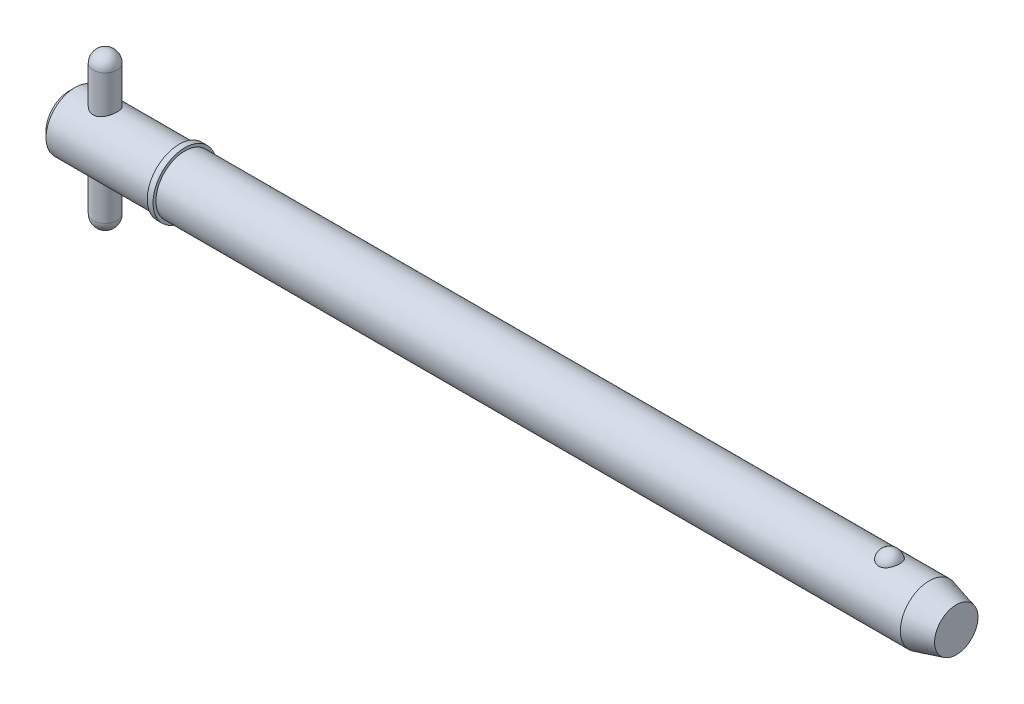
ISO-10303-21;
HEADER;
FILE_DESCRIPTION(('STEP AP214'),'2;1');
FILE_NAME('part.step','',(''),(''),'','','');
FILE_SCHEMA(('AUTOMOTIVE_DESIGN { 1 0 10303 214 1 1 1 1 }'));
ENDSEC;
DATA;
#1=APPLICATION_CONTEXT('core data for automotive mechanical design processes');
#2=APPLICATION_PROTOCOL_DEFINITION('international standard','automotive_design',2000,#1);
#3=PRODUCT_CONTEXT('',#1,'mechanical');
#4=PRODUCT('Part','Part','',(#3));
#5=PRODUCT_RELATED_PRODUCT_CATEGORY('part','',(#4));
#6=PRODUCT_DEFINITION_FORMATION('','',#4);
#7=PRODUCT_DEFINITION_CONTEXT('part definition',#1,'design');
#8=PRODUCT_DEFINITION('design','',#6,#7);
#9=PRODUCT_DEFINITION_SHAPE('','',#8);
#10=(LENGTH_UNIT() NAMED_UNIT(*) SI_UNIT(.MILLI.,.METRE.));
#11=(NAMED_UNIT(*) PLANE_ANGLE_UNIT() SI_UNIT($,.RADIAN.));
#12=(NAMED_UNIT(*) SI_UNIT($,.STERADIAN.) SOLID_ANGLE_UNIT());
#13=UNCERTAINTY_MEASURE_WITH_UNIT(LENGTH_MEASURE(1.E-05),#10,'distance_accuracy_value','');
#14=(GEOMETRIC_REPRESENTATION_CONTEXT(3) GLOBAL_UNCERTAINTY_ASSIGNED_CONTEXT((#13)) GLOBAL_UNIT_ASSIGNED_CONTEXT((#10,
#11,#12)) REPRESENTATION_CONTEXT('',''));
#15=CARTESIAN_POINT('',(0.,0.,0.));
#16=DIRECTION('',(0.,0.,1.));
#17=DIRECTION('',(1.,0.,0.));
#18=AXIS2_PLACEMENT_3D('',#15,#16,#17);
#19=CARTESIAN_POINT('',(5.94,12.7,0.));
#20=DIRECTION('',(0.,-1.,0.));
#21=DIRECTION('',(0.,0.,-1.));
#22=AXIS2_PLACEMENT_3D('',#19,#20,#21);
#23=CYLINDRICAL_SURFACE('',#22,1.98);
#24=CARTESIAN_POINT('',(5.94,-10.72,0.));
#25=DIRECTION('',(0.,-1.,0.));
#26=DIRECTION('',(0.,0.,-1.));
#27=AXIS2_PLACEMENT_3D('',#24,#25,#26);
#28=CIRCLE('',#27,1.98);
#29=CARTESIAN_POINT('',(5.94,-10.72,-1.98));
#30=VERTEX_POINT('',#29);
#31=EDGE_CURVE('P0_E10',#30,#30,#28,.F.);
#32=ORIENTED_EDGE('',*,*,#31,.T.);
#33=EDGE_LOOP('',(#32));
#34=FACE_BOUND('',#33,.T.);
#35=CARTESIAN_POINT('',(5.94,10.72,0.));
#36=DIRECTION('',(0.,-1.,0.));
#37=DIRECTION('',(0.,0.,-1.));
#38=AXIS2_PLACEMENT_3D('',#35,#36,#37);
#39=CIRCLE('',#38,1.98);
#40=CARTESIAN_POINT('',(5.94,10.72,-1.98));
#41=VERTEX_POINT('',#40);
#42=EDGE_CURVE('P0_E21',#41,#41,#39,.T.);
#43=ORIENTED_EDGE('',*,*,#42,.T.);
#44=EDGE_LOOP('',(#43));
#45=FACE_BOUND('',#44,.T.);
#46=ADVANCED_FACE('P0_F14',(#34,#45),#23,.T.);
#47=CARTESIAN_POINT('',(5.94,-10.72,0.));
#48=DIRECTION('',(0.,0.,1.));
#49=DIRECTION('',(1.,0.,0.));
#50=AXIS2_PLACEMENT_3D('',#47,#48,#49);
#51=SPHERICAL_SURFACE('',#50,1.98);
#52=CARTESIAN_POINT('',(5.94,-10.72,0.));
#53=DIRECTION('',(0.,-1.,0.));
#54=DIRECTION('',(0.,0.,-1.));
#55=AXIS2_PLACEMENT_3D('',#52,#53,#54);
#56=SPHERICAL_SURFACE('',#55,1.98);
#57=ORIENTED_EDGE('',*,*,#31,.F.);
#58=EDGE_LOOP('',(#57));
#59=FACE_BOUND('',#58,.T.);
#60=ADVANCED_FACE('P0_F29',(#59),#56,.T.);
#61=CARTESIAN_POINT('',(5.94,10.72,0.));
#62=DIRECTION('',(0.,0.,1.));
#63=DIRECTION('',(1.,0.,0.));
#64=AXIS2_PLACEMENT_3D('',#61,#62,#63);
#65=SPHERICAL_SURFACE('',#64,1.98);
#66=CARTESIAN_POINT('',(5.94,10.72,0.));
#67=DIRECTION('',(0.,-1.,0.));
#68=DIRECTION('',(0.,0.,-1.));
#69=AXIS2_PLACEMENT_3D('',#66,#67,#68);
#70=SPHERICAL_SURFACE('',#69,1.98);
#71=ORIENTED_EDGE('',*,*,#42,.F.);
#72=EDGE_LOOP('',(#71));
#73=FACE_BOUND('',#72,.T.);
#74=ADVANCED_FACE('P0_F16',(#73),#70,.T.);
#75=CLOSED_SHELL('',(#46,#60,#74));
#76=MANIFOLD_SOLID_BREP('P0_B1',#75);
#77=CARTESIAN_POINT('',(0.,0.,0.));
#78=DIRECTION('',(1.,0.,0.));
#79=DIRECTION('',(0.,0.,-1.));
#80=AXIS2_PLACEMENT_3D('',#77,#78,#79);
#81=CYLINDRICAL_SURFACE('',#80,4.765);
#82=CARTESIAN_POINT('',(141.604194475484,0.,0.));
#83=DIRECTION('',(1.,0.,0.));
#84=DIRECTION('',(0.,0.,-1.));
#85=AXIS2_PLACEMENT_3D('',#82,#83,#84);
#86=CIRCLE('',#85,4.765);
#87=CARTESIAN_POINT('',(141.604194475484,0.,-4.765));
#88=VERTEX_POINT('',#87);
#89=EDGE_CURVE('P1_E81',#88,#88,#86,.T.);
#90=ORIENTED_EDGE('',*,*,#89,.F.);
#91=EDGE_LOOP('',(#90));
#92=FACE_BOUND('',#91,.T.);
#93=CARTESIAN_POINT('',(19.05,0.,0.));
#94=DIRECTION('',(1.,0.,0.));
#95=DIRECTION('',(0.,0.,-1.));
#96=AXIS2_PLACEMENT_3D('',#93,#94,#95);
#97=CIRCLE('',#96,4.765);
#98=CARTESIAN_POINT('',(19.05,0.,-4.765));
#99=VERTEX_POINT('',#98);
#100=EDGE_CURVE('P1_E85',#99,#99,#97,.T.);
#101=ORIENTED_EDGE('',*,*,#100,.T.);
#102=EDGE_LOOP('',(#101));
#103=FACE_BOUND('',#102,.T.);
#104=CARTESIAN_POINT('',(135.051020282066,4.42764777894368,1.76101111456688));
#105=CARTESIAN_POINT('',(134.959721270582,4.42764470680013,1.76101422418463));
#106=CARTESIAN_POINT('',(134.868446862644,4.43059091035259,1.75366340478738));
#107=CARTESIAN_POINT('',(134.688615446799,4.44201846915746,1.72451180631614));
#108=CARTESIAN_POINT('',(134.600057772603,4.45049845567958,1.70271460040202));
#109=CARTESIAN_POINT('',(134.428257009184,4.47200516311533,1.64539370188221));
#110=CARTESIAN_POINT('',(134.345006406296,4.48502527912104,1.60988994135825));
#111=CARTESIAN_POINT('',(134.185763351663,4.51419542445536,1.52617873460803));
#112=CARTESIAN_POINT('',(134.109772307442,4.53034605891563,1.47796883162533));
#113=CARTESIAN_POINT('',(133.964744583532,4.56459317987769,1.36860494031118));
#114=CARTESIAN_POINT('',(133.895964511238,4.58273170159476,1.30712420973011));
#115=CARTESIAN_POINT('',(133.769342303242,4.61870302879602,1.17370204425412));
#116=CARTESIAN_POINT('',(133.711502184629,4.63653577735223,1.10175868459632));
#117=CARTESIAN_POINT('',(133.605570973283,4.67090140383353,0.945806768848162));
#118=CARTESIAN_POINT('',(133.558030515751,4.68734068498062,0.861402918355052));
#119=CARTESIAN_POINT('',(133.477081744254,4.71628466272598,0.685442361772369));
#120=CARTESIAN_POINT('',(133.443674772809,4.72878898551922,0.593884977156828));
#121=CARTESIAN_POINT('',(133.391287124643,4.74874061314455,0.404781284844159));
#122=CARTESIAN_POINT('',(133.372517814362,4.75611366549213,0.307168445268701));
#123=CARTESIAN_POINT('',(133.350584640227,4.76475393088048,0.109940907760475));
#124=CARTESIAN_POINT('',(133.347420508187,4.76602124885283,0.0103262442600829));
#125=CARTESIAN_POINT('',(133.356740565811,4.76232928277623,-0.187629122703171));
#126=CARTESIAN_POINT('',(133.369158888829,4.7573962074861,-0.285973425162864));
#127=CARTESIAN_POINT('',(133.409280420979,4.74184975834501,-0.479027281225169));
#128=CARTESIAN_POINT('',(133.436983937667,4.7312362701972,-0.573736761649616));
#129=CARTESIAN_POINT('',(133.507158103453,4.70540026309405,-0.756973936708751));
#130=CARTESIAN_POINT('',(133.549646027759,4.69017235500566,-0.845494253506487));
#131=CARTESIAN_POINT('',(133.648520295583,4.6566986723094,-1.01378033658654));
#132=CARTESIAN_POINT('',(133.704907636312,4.63845268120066,-1.09354547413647));
#133=CARTESIAN_POINT('',(133.830552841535,4.60085438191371,-1.24228523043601));
#134=CARTESIAN_POINT('',(133.899843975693,4.58149930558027,-1.31123108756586));
#135=CARTESIAN_POINT('',(134.049606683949,4.54391653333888,-1.43607409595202));
#136=CARTESIAN_POINT('',(134.130077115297,4.52568872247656,-1.49197257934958));
#137=CARTESIAN_POINT('',(134.298150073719,4.49293007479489,-1.58786764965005));
#138=CARTESIAN_POINT('',(134.385544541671,4.47832346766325,-1.62820219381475));
#139=CARTESIAN_POINT('',(134.566553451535,4.45406011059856,-1.69345757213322));
#140=CARTESIAN_POINT('',(134.66016555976,4.44440151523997,-1.71838415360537));
#141=CARTESIAN_POINT('',(134.845893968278,4.43159888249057,-1.75112843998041));
#142=CARTESIAN_POINT('',(134.937849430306,4.42815213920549,-1.75974223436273));
#143=CARTESIAN_POINT('',(135.121965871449,4.427247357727,-1.76201865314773));
#144=CARTESIAN_POINT('',(135.214126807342,4.42978816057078,-1.7556841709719));
#145=CARTESIAN_POINT('',(135.393129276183,4.44038648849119,-1.72869560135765));
#146=CARTESIAN_POINT('',(135.480047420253,4.44827555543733,-1.70847853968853));
#147=CARTESIAN_POINT('',(135.649131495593,4.46852246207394,-1.65479562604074));
#148=CARTESIAN_POINT('',(135.731297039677,4.48088066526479,-1.62132869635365));
#149=CARTESIAN_POINT('',(135.890591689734,4.50907357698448,-1.54120560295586));
#150=CARTESIAN_POINT('',(135.967570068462,4.52497884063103,-1.49427526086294));
#151=CARTESIAN_POINT('',(136.112708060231,4.55845148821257,-1.38881222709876));
#152=CARTESIAN_POINT('',(136.180865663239,4.57601924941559,-1.33027689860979));
#153=CARTESIAN_POINT('',(136.310099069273,4.61196537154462,-1.1999104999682));
#154=CARTESIAN_POINT('',(136.370656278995,4.63034074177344,-1.12756415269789));
#155=CARTESIAN_POINT('',(136.479279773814,4.66513959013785,-0.97361299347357));
#156=CARTESIAN_POINT('',(136.527343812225,4.68156271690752,-0.892006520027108));
#157=CARTESIAN_POINT('',(136.611383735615,4.71130224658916,-0.718892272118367));
#158=CARTESIAN_POINT('',(136.646918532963,4.724501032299,-0.627149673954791));
#159=CARTESIAN_POINT('',(136.702952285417,4.74571823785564,-0.438611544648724));
#160=CARTESIAN_POINT('',(136.723450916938,4.75373654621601,-0.34181590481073));
#161=CARTESIAN_POINT('',(136.749033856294,4.76378905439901,-0.14563306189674));
#162=CARTESIAN_POINT('',(136.754076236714,4.76580697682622,-0.0462395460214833));
#163=CARTESIAN_POINT('',(136.748523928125,4.7636057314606,0.152038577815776));
#164=CARTESIAN_POINT('',(136.737929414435,4.75938663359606,0.250923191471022));
#165=CARTESIAN_POINT('',(136.701387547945,4.74516937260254,0.445004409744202));
#166=CARTESIAN_POINT('',(136.675496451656,4.73519238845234,0.540213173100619));
#167=CARTESIAN_POINT('',(136.608927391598,4.71049394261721,0.724662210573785));
#168=CARTESIAN_POINT('',(136.568248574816,4.69577220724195,0.813902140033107));
#169=CARTESIAN_POINT('',(136.472717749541,4.66303767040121,0.984313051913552));
#170=CARTESIAN_POINT('',(136.417804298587,4.64501070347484,1.06544688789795));
#171=CARTESIAN_POINT('',(136.295049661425,4.60764678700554,1.21692673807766));
#172=CARTESIAN_POINT('',(136.227208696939,4.58830985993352,1.28727293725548));
#173=CARTESIAN_POINT('',(136.080548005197,4.55060370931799,1.41479271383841));
#174=CARTESIAN_POINT('',(136.001791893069,4.53222967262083,1.47203785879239));
#175=CARTESIAN_POINT('',(135.834989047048,4.49849576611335,1.57212016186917));
#176=CARTESIAN_POINT('',(135.746941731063,4.48313608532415,1.6149564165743));
#177=CARTESIAN_POINT('',(135.559791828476,4.45676184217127,1.68642657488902));
#178=CARTESIAN_POINT('',(135.460365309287,4.44598302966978,1.71430590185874));
#179=CARTESIAN_POINT('',(135.257621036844,4.43142918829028,1.7515925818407));
#180=CARTESIAN_POINT('',(135.154304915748,4.42765125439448,1.76100759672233));
#181=CARTESIAN_POINT('',(135.051020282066,4.42764777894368,1.76101111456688));
#182=B_SPLINE_CURVE_WITH_KNOTS('',3,(#104,#105,#106,#107,#108,#109,#110,#111,#112,#113,#114,
#115,#116,#117,#118,#119,#120,#121,#122,#123,#124,#125,#126,#127,#128,#129,#130,#131,#132,#133,
#134,#135,#136,#137,#138,#139,#140,#141,#142,#143,#144,#145,#146,#147,#148,#149,#150,#151,#152,
#153,#154,#155,#156,#157,#158,#159,#160,#161,#162,#163,#164,#165,#166,#167,#168,#169,#170,#171,
#172,#173,#174,#175,#176,#177,#178,#179,#180,#181),.UNSPECIFIED.,.T.,.F.,(4,2,2,2,2,2,2,2,2,2,2,
2,2,2,2,2,2,2,2,2,2,2,2,2,2,2,2,2,2,2,2,2,2,2,2,2,2,2,4),(0.,0.273517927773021,
0.546968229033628,0.820022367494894,1.09312934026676,1.37393946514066,1.6548013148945,
1.94820420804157,2.24163496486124,2.53922817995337,2.83681628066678,3.13315071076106,
3.42949110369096,3.72617893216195,4.02288805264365,4.32037303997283,4.61782764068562,
4.90840095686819,5.19886582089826,5.47474855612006,5.75057789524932,6.0180997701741,
6.28564340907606,6.55907787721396,6.83257454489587,7.11962987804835,7.40673679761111,
7.70312663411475,7.9995228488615,8.29672237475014,8.59391856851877,8.89002850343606,
9.18615552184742,9.48358266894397,9.7810047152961,10.0767610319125,10.3725358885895,
10.6820893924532,10.991514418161),.UNSPECIFIED.);
#183=CARTESIAN_POINT('',(135.051020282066,4.42764777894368,1.76101111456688));
#184=VERTEX_POINT('',#183);
#185=EDGE_CURVE('P1_E35',#184,#184,#182,.T.);
#186=ORIENTED_EDGE('',*,*,#185,.T.);
#187=EDGE_LOOP('',(#186));
#188=FACE_BOUND('',#187,.T.);
#189=ADVANCED_FACE('P1_F13',(#92,#103,#188),#81,.T.);
#190=CARTESIAN_POINT('',(0.,0.,0.));
#191=DIRECTION('',(-1.,0.,0.));
#192=DIRECTION('',(0.,0.,1.));
#193=AXIS2_PLACEMENT_3D('',#190,#191,#192);
#194=PLANE('',#193);
#195=CARTESIAN_POINT('',(0.,0.,0.));
#196=DIRECTION('',(1.,0.,0.));
#197=DIRECTION('',(0.,0.,-1.));
#198=AXIS2_PLACEMENT_3D('',#195,#196,#197);
#199=CIRCLE('',#198,3.812);
#200=CARTESIAN_POINT('',(0.,0.,-3.812));
#201=VERTEX_POINT('',#200);
#202=EDGE_CURVE('P1_E9',#201,#201,#199,.T.);
#203=ORIENTED_EDGE('',*,*,#202,.F.);
#204=EDGE_LOOP('',(#203));
#205=FACE_BOUND('',#204,.T.);
#206=ADVANCED_FACE('P1_F15',(#205),#194,.T.);
#207=CARTESIAN_POINT('',(0.952999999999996,0.,0.));
#208=DIRECTION('',(1.,0.,0.));
#209=DIRECTION('',(0.,0.,-1.));
#210=AXIS2_PLACEMENT_3D('',#207,#208,#209);
#211=CONICAL_SURFACE('',#210,4.765,0.78539816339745);
#212=ORIENTED_EDGE('',*,*,#202,.T.);
#213=EDGE_LOOP('',(#212));
#214=FACE_BOUND('',#213,.T.);
#215=CARTESIAN_POINT('',(0.952999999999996,0.,0.));
#216=DIRECTION('',(1.,0.,0.));
#217=DIRECTION('',(0.,0.,-1.));
#218=AXIS2_PLACEMENT_3D('',#215,#216,#217);
#219=CIRCLE('',#218,4.765);
#220=CARTESIAN_POINT('',(0.952999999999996,0.,-4.765));
#221=VERTEX_POINT('',#220);
#222=EDGE_CURVE('P1_E26',#221,#221,#219,.T.);
#223=ORIENTED_EDGE('',*,*,#222,.F.);
#224=EDGE_LOOP('',(#223));
#225=FACE_BOUND('',#224,.T.);
#226=ADVANCED_FACE('P1_F77',(#214,#225),#211,.T.);
#227=CARTESIAN_POINT('',(0.,0.,0.));
#228=DIRECTION('',(1.,0.,0.));
#229=DIRECTION('',(0.,0.,-1.));
#230=AXIS2_PLACEMENT_3D('',#227,#228,#229);
#231=CYLINDRICAL_SURFACE('',#230,4.765);
#232=CARTESIAN_POINT('',(5.94,-4.33414639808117,1.98));
#233=CARTESIAN_POINT('',(5.83435484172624,-4.33415447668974,1.97999169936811));
#234=CARTESIAN_POINT('',(5.72854887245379,-4.33806396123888,1.97149330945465));
#235=CARTESIAN_POINT('',(5.51998191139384,-4.35319906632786,1.93783487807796));
#236=CARTESIAN_POINT('',(5.41723000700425,-4.3644446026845,1.91262947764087));
#237=CARTESIAN_POINT('',(5.21817294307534,-4.39274225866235,1.84670269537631));
#238=CARTESIAN_POINT('',(5.12184344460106,-4.40977076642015,1.80604432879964));
#239=CARTESIAN_POINT('',(4.93740039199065,-4.44768106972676,1.71055160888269));
#240=CARTESIAN_POINT('',(4.84928487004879,-4.46856193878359,1.65572066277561));
#241=CARTESIAN_POINT('',(4.67826533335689,-4.51326966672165,1.52981120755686));
#242=CARTESIAN_POINT('',(4.59593118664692,-4.53719608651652,1.45799365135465));
#243=CARTESIAN_POINT('',(4.44405452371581,-4.58448035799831,1.30170177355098));
#244=CARTESIAN_POINT('',(4.37451692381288,-4.60783798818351,1.21722260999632));
#245=CARTESIAN_POINT('',(4.24730683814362,-4.65256187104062,1.03353484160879));
#246=CARTESIAN_POINT('',(4.19027484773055,-4.67379892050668,0.933848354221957));
#247=CARTESIAN_POINT('',(4.0940363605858,-4.7106711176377,0.7252544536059));
#248=CARTESIAN_POINT('',(4.05482199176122,-4.72630873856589,0.61635113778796));
#249=CARTESIAN_POINT('',(3.99739515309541,-4.74951416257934,0.398397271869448));
#250=CARTESIAN_POINT('',(3.97820018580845,-4.7574579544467,0.289646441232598));
#251=CARTESIAN_POINT('',(3.95818309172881,-4.76574596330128,0.0701967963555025));
#252=CARTESIAN_POINT('',(3.95735355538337,-4.76609324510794,-0.0405012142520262));
#253=CARTESIAN_POINT('',(3.9735743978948,-4.75937098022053,-0.253561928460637));
#254=CARTESIAN_POINT('',(3.98954548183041,-4.75274912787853,-0.356023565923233));
#255=CARTESIAN_POINT('',(4.03706504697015,-4.73344665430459,-0.556659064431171));
#256=CARTESIAN_POINT('',(4.06861467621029,-4.72076558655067,-0.654832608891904));
#257=CARTESIAN_POINT('',(4.14677192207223,-4.69032846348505,-0.845904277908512));
#258=CARTESIAN_POINT('',(4.19360181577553,-4.67249797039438,-0.938699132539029));
#259=CARTESIAN_POINT('',(4.30077315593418,-4.63350852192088,-1.11535616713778));
#260=CARTESIAN_POINT('',(4.3611193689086,-4.61234839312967,-1.19921518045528));
#261=CARTESIAN_POINT('',(4.49853487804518,-4.56707259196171,-1.3618711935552));
#262=CARTESIAN_POINT('',(4.57648039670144,-4.5428537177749,-1.43990029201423));
#263=CARTESIAN_POINT('',(4.74440779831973,-4.49530722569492,-1.58211009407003));
#264=CARTESIAN_POINT('',(4.83439425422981,-4.47197995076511,-1.64628551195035));
#265=CARTESIAN_POINT('',(5.02755026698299,-4.42812342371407,-1.76092221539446));
#266=CARTESIAN_POINT('',(5.13105348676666,-4.40770990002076,-1.81086937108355));
#267=CARTESIAN_POINT('',(5.34607555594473,-4.37336901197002,-1.89231211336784));
#268=CARTESIAN_POINT('',(5.45758864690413,-4.3594370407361,-1.92382080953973));
#269=CARTESIAN_POINT('',(5.67777275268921,-4.34077746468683,-1.96554536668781));
#270=CARTESIAN_POINT('',(5.78616167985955,-4.33551319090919,-1.9770057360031));
#271=CARTESIAN_POINT('',(6.00341835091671,-4.33325118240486,-1.98196183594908));
#272=CARTESIAN_POINT('',(6.11228591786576,-4.33625061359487,-1.97546372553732));
#273=CARTESIAN_POINT('',(6.32012423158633,-4.34962383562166,-1.94582288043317));
#274=CARTESIAN_POINT('',(6.41928436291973,-4.35951709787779,-1.92376364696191));
#275=CARTESIAN_POINT('',(6.61241543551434,-4.38495043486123,-1.86506038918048));
#276=CARTESIAN_POINT('',(6.70638516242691,-4.40049182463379,-1.82841296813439));
#277=CARTESIAN_POINT('',(6.89090272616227,-4.43627016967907,-1.73985559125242));
#278=CARTESIAN_POINT('',(6.98113841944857,-4.45667771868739,-1.68736639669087));
#279=CARTESIAN_POINT('',(7.1519532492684,-4.49964530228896,-1.56919282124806));
#280=CARTESIAN_POINT('',(7.232528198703,-4.52220626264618,-1.50350275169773));
#281=CARTESIAN_POINT('',(7.38851617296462,-4.56914071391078,-1.35452895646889));
#282=CARTESIAN_POINT('',(7.46298462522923,-4.5935132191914,-1.27025197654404));
#283=CARTESIAN_POINT('',(7.59689029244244,-4.63962841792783,-1.08983181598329));
#284=CARTESIAN_POINT('',(7.65632644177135,-4.66137092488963,-0.993687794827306));
#285=CARTESIAN_POINT('',(7.75840361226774,-4.69991192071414,-0.791608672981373));
#286=CARTESIAN_POINT('',(7.80100481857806,-4.71669866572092,-0.685651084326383));
#287=CARTESIAN_POINT('',(7.86746997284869,-4.74331408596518,-0.467197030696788));
#288=CARTESIAN_POINT('',(7.8913450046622,-4.75314687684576,-0.354704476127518));
#289=CARTESIAN_POINT('',(7.91828971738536,-4.76427543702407,-0.134819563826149));
#290=CARTESIAN_POINT('',(7.92269147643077,-4.76611762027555,-0.027616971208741));
#291=CARTESIAN_POINT('',(7.91414154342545,-4.76256684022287,0.185959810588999));
#292=CARTESIAN_POINT('',(7.90119286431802,-4.75717513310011,0.292334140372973));
#293=CARTESIAN_POINT('',(7.85926572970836,-4.74004856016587,0.497383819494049));
#294=CARTESIAN_POINT('',(7.83086647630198,-4.72854322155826,0.596198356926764));
#295=CARTESIAN_POINT('',(7.75947503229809,-4.70045111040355,0.787624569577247));
#296=CARTESIAN_POINT('',(7.71648006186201,-4.68386336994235,0.880235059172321));
#297=CARTESIAN_POINT('',(7.6149456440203,-4.64628321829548,1.06122875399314));
#298=CARTESIAN_POINT('',(7.55579211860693,-4.62512577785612,1.14923242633));
#299=CARTESIAN_POINT('',(7.42451813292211,-4.58091700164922,1.31443888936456));
#300=CARTESIAN_POINT('',(7.35239289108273,-4.5578649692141,1.39163767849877));
#301=CARTESIAN_POINT('',(7.19146107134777,-4.51050832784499,1.53847013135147));
#302=CARTESIAN_POINT('',(7.10185635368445,-4.48622440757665,1.60723941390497));
#303=CARTESIAN_POINT('',(6.91164948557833,-4.44076541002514,1.72888900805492));
#304=CARTESIAN_POINT('',(6.81104124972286,-4.41959206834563,1.78176046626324));
#305=CARTESIAN_POINT('',(6.60181953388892,-4.38318936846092,1.86953227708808));
#306=CARTESIAN_POINT('',(6.49325511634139,-4.3679267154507,1.90453365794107));
#307=CARTESIAN_POINT('',(6.32681512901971,-4.35102038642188,1.94268459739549));
#308=CARTESIAN_POINT('',(6.27079191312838,-4.34638447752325,1.953006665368));
#309=CARTESIAN_POINT('',(6.15793999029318,-4.33925923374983,1.96879053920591));
#310=CARTESIAN_POINT('',(6.10111188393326,-4.33676837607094,1.97425579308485));
#311=CARTESIAN_POINT('',(6.00947316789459,-4.33456308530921,1.97908711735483));
#312=CARTESIAN_POINT('',(5.97474528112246,-4.33414374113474,1.98000272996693));
#313=CARTESIAN_POINT('',(5.94,-4.33414639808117,1.98));
#314=B_SPLINE_CURVE_WITH_KNOTS('',3,(#232,#233,#234,#235,#236,#237,#238,#239,#240,#241,#242,
#243,#244,#245,#246,#247,#248,#249,#250,#251,#252,#253,#254,#255,#256,#257,#258,#259,#260,#261,
#262,#263,#264,#265,#266,#267,#268,#269,#270,#271,#272,#273,#274,#275,#276,#277,#278,#279,#280,
#281,#282,#283,#284,#285,#286,#287,#288,#289,#290,#291,#292,#293,#294,#295,#296,#297,#298,#299,
#300,#301,#302,#303,#304,#305,#306,#307,#308,#309,#310,#311,#312,#313),.UNSPECIFIED.,.T.,.F.,(4,
2,2,2,2,2,2,2,2,2,2,2,2,2,2,2,2,2,2,2,2,2,2,2,2,2,2,2,2,2,2,2,2,2,2,2,2,2,2,2,4),(0.,
0.316814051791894,0.634491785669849,0.950887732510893,1.2672076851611,1.60127705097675,
1.93547449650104,2.28407463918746,2.63252061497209,2.96292077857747,3.29318763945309,
3.60346227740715,3.91375978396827,4.22878888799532,4.54392926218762,4.88117914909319,
5.21855748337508,5.56691259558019,5.91501972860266,6.24062939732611,6.56612741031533,
6.87094948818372,7.17584258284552,7.49361276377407,7.81152017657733,8.15513975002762,
8.4987836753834,8.8432355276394,9.18748334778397,9.50777781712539,9.8280166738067,
10.1370037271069,10.4460496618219,10.7690461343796,11.0921619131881,11.4371238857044,
11.7822776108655,12.1254577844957,12.2967183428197,12.4678572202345,12.5720531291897),.UNSPECIFIED.);
#315=CARTESIAN_POINT('',(5.94,-4.33414639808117,1.98));
#316=VERTEX_POINT('',#315);
#317=EDGE_CURVE('P1_E17',#316,#316,#314,.T.);
#318=ORIENTED_EDGE('',*,*,#317,.F.);
#319=EDGE_LOOP('',(#318));
#320=FACE_BOUND('',#319,.T.);
#321=CARTESIAN_POINT('',(5.94,4.33414639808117,1.98));
#322=CARTESIAN_POINT('',(6.04564515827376,4.33415447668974,1.97999169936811));
#323=CARTESIAN_POINT('',(6.15145112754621,4.33806396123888,1.97149330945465));
#324=CARTESIAN_POINT('',(6.36001808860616,4.35319906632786,1.93783487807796));
#325=CARTESIAN_POINT('',(6.46276999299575,4.3644446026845,1.91262947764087));
#326=CARTESIAN_POINT('',(6.66182705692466,4.39274225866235,1.84670269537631));
#327=CARTESIAN_POINT('',(6.75815655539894,4.40977076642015,1.80604432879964));
#328=CARTESIAN_POINT('',(6.94259960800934,4.44768106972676,1.71055160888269));
#329=CARTESIAN_POINT('',(7.03071512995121,4.46856193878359,1.65572066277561));
#330=CARTESIAN_POINT('',(7.20173466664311,4.51326966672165,1.52981120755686));
#331=CARTESIAN_POINT('',(7.28406881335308,4.53719608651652,1.45799365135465));
#332=CARTESIAN_POINT('',(7.43594547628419,4.58448035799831,1.30170177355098));
#333=CARTESIAN_POINT('',(7.50548307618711,4.60783798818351,1.21722260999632));
#334=CARTESIAN_POINT('',(7.63269316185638,4.65256187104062,1.03353484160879));
#335=CARTESIAN_POINT('',(7.68972515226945,4.67379892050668,0.933848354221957));
#336=CARTESIAN_POINT('',(7.7859636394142,4.7106711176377,0.7252544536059));
#337=CARTESIAN_POINT('',(7.82517800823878,4.72630873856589,0.61635113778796));
#338=CARTESIAN_POINT('',(7.88260484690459,4.74951416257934,0.398397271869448));
#339=CARTESIAN_POINT('',(7.90179981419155,4.7574579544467,0.289646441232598));
#340=CARTESIAN_POINT('',(7.92181690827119,4.76574596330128,0.0701967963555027));
#341=CARTESIAN_POINT('',(7.92264644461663,4.76609324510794,-0.040501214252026));
#342=CARTESIAN_POINT('',(7.9064256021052,4.75937098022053,-0.253561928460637));
#343=CARTESIAN_POINT('',(7.89045451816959,4.75274912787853,-0.356023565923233));
#344=CARTESIAN_POINT('',(7.84293495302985,4.73344665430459,-0.55665906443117));
#345=CARTESIAN_POINT('',(7.81138532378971,4.72076558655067,-0.654832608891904));
#346=CARTESIAN_POINT('',(7.73322807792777,4.69032846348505,-0.845904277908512));
#347=CARTESIAN_POINT('',(7.68639818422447,4.67249797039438,-0.938699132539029));
#348=CARTESIAN_POINT('',(7.57922684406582,4.63350852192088,-1.11535616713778));
#349=CARTESIAN_POINT('',(7.5188806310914,4.61234839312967,-1.19921518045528));
#350=CARTESIAN_POINT('',(7.38146512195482,4.56707259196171,-1.3618711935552));
#351=CARTESIAN_POINT('',(7.30351960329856,4.5428537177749,-1.43990029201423));
#352=CARTESIAN_POINT('',(7.13559220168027,4.49530722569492,-1.58211009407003));
#353=CARTESIAN_POINT('',(7.04560574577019,4.47197995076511,-1.64628551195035));
#354=CARTESIAN_POINT('',(6.85244973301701,4.42812342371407,-1.76092221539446));
#355=CARTESIAN_POINT('',(6.74894651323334,4.40770990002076,-1.81086937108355));
#356=CARTESIAN_POINT('',(6.53392444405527,4.37336901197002,-1.89231211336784));
#357=CARTESIAN_POINT('',(6.42241135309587,4.3594370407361,-1.92382080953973));
#358=CARTESIAN_POINT('',(6.20222724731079,4.34077746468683,-1.96554536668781));
#359=CARTESIAN_POINT('',(6.09383832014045,4.33551319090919,-1.9770057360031));
#360=CARTESIAN_POINT('',(5.87658164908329,4.33325118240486,-1.98196183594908));
#361=CARTESIAN_POINT('',(5.76771408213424,4.33625061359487,-1.97546372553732));
#362=CARTESIAN_POINT('',(5.55987576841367,4.34962383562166,-1.94582288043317));
#363=CARTESIAN_POINT('',(5.46071563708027,4.35951709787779,-1.92376364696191));
#364=CARTESIAN_POINT('',(5.26758456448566,4.38495043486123,-1.86506038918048));
#365=CARTESIAN_POINT('',(5.17361483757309,4.40049182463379,-1.82841296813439));
#366=CARTESIAN_POINT('',(4.98909727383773,4.43627016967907,-1.73985559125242));
#367=CARTESIAN_POINT('',(4.89886158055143,4.45667771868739,-1.68736639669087));
#368=CARTESIAN_POINT('',(4.72804675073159,4.49964530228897,-1.56919282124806));
#369=CARTESIAN_POINT('',(4.647471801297,4.52220626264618,-1.50350275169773));
#370=CARTESIAN_POINT('',(4.49148382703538,4.56914071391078,-1.35452895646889));
#371=CARTESIAN_POINT('',(4.41701537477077,4.5935132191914,-1.27025197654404));
#372=CARTESIAN_POINT('',(4.28310970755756,4.63962841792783,-1.08983181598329));
#373=CARTESIAN_POINT('',(4.22367355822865,4.66137092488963,-0.993687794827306));
#374=CARTESIAN_POINT('',(4.12159638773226,4.69991192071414,-0.791608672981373));
#375=CARTESIAN_POINT('',(4.07899518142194,4.71669866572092,-0.685651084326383));
#376=CARTESIAN_POINT('',(4.01253002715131,4.74331408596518,-0.467197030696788));
#377=CARTESIAN_POINT('',(3.98865499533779,4.75314687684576,-0.354704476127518));
#378=CARTESIAN_POINT('',(3.96171028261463,4.76427543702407,-0.134819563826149));
#379=CARTESIAN_POINT('',(3.95730852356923,4.76611762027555,-0.0276169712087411));
#380=CARTESIAN_POINT('',(3.96585845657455,4.76256684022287,0.185959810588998));
#381=CARTESIAN_POINT('',(3.97880713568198,4.75717513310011,0.292334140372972));
#382=CARTESIAN_POINT('',(4.02073427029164,4.74004856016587,0.497383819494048));
#383=CARTESIAN_POINT('',(4.04913352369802,4.72854322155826,0.596198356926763));
#384=CARTESIAN_POINT('',(4.12052496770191,4.70045111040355,0.787624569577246));
#385=CARTESIAN_POINT('',(4.16351993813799,4.68386336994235,0.880235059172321));
#386=CARTESIAN_POINT('',(4.2650543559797,4.64628321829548,1.06122875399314));
#387=CARTESIAN_POINT('',(4.32420788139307,4.62512577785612,1.14923242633));
#388=CARTESIAN_POINT('',(4.45548186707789,4.58091700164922,1.31443888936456));
#389=CARTESIAN_POINT('',(4.52760710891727,4.5578649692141,1.39163767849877));
#390=CARTESIAN_POINT('',(4.68853892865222,4.51050832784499,1.53847013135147));
#391=CARTESIAN_POINT('',(4.77814364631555,4.48622440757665,1.60723941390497));
#392=CARTESIAN_POINT('',(4.96835051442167,4.44076541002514,1.72888900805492));
#393=CARTESIAN_POINT('',(5.06895875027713,4.41959206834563,1.78176046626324));
#394=CARTESIAN_POINT('',(5.27818046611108,4.38318936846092,1.86953227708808));
#395=CARTESIAN_POINT('',(5.38674488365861,4.3679267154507,1.90453365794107));
#396=CARTESIAN_POINT('',(5.55318487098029,4.35102038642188,1.94268459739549));
#397=CARTESIAN_POINT('',(5.60920808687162,4.34638447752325,1.953006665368));
#398=CARTESIAN_POINT('',(5.72206000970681,4.33925923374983,1.96879053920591));
#399=CARTESIAN_POINT('',(5.77888811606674,4.33676837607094,1.97425579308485));
#400=CARTESIAN_POINT('',(5.87052683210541,4.33456308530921,1.97908711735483));
#401=CARTESIAN_POINT('',(5.90525471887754,4.33414374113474,1.98000272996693));
#402=CARTESIAN_POINT('',(5.94,4.33414639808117,1.98));
#403=B_SPLINE_CURVE_WITH_KNOTS('',3,(#321,#322,#323,#324,#325,#326,#327,#328,#329,#330,#331,
#332,#333,#334,#335,#336,#337,#338,#339,#340,#341,#342,#343,#344,#345,#346,#347,#348,#349,#350,
#351,#352,#353,#354,#355,#356,#357,#358,#359,#360,#361,#362,#363,#364,#365,#366,#367,#368,#369,
#370,#371,#372,#373,#374,#375,#376,#377,#378,#379,#380,#381,#382,#383,#384,#385,#386,#387,#388,
#389,#390,#391,#392,#393,#394,#395,#396,#397,#398,#399,#400,#401,#402),.UNSPECIFIED.,.T.,.F.,(4,
2,2,2,2,2,2,2,2,2,2,2,2,2,2,2,2,2,2,2,2,2,2,2,2,2,2,2,2,2,2,2,2,2,2,2,2,2,2,2,4),(0.,
0.316814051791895,0.634491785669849,0.950887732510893,1.2672076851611,1.60127705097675,
1.93547449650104,2.28407463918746,2.63252061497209,2.96292077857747,3.29318763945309,
3.60346227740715,3.91375978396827,4.22878888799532,4.54392926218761,4.88117914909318,
5.21855748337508,5.56691259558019,5.91501972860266,6.24062939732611,6.56612741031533,
6.87094948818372,7.17584258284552,7.49361276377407,7.81152017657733,8.15513975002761,
8.4987836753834,8.84323552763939,9.18748334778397,9.50777781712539,9.8280166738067,
10.1370037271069,10.4460496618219,10.7690461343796,11.0921619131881,11.4371238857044,
11.7822776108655,12.1254577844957,12.2967183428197,12.4678572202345,12.5720531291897),.UNSPECIFIED.);
#404=CARTESIAN_POINT('',(5.94,4.33414639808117,1.98));
#405=VERTEX_POINT('',#404);
#406=EDGE_CURVE('P1_E43',#405,#405,#403,.T.);
#407=ORIENTED_EDGE('',*,*,#406,.F.);
#408=EDGE_LOOP('',(#407));
#409=FACE_BOUND('',#408,.T.);
#410=ORIENTED_EDGE('',*,*,#222,.T.);
#411=EDGE_LOOP('',(#410));
#412=FACE_BOUND('',#411,.T.);
#413=CARTESIAN_POINT('',(18.097,0.,0.));
#414=DIRECTION('',(1.,0.,0.));
#415=DIRECTION('',(0.,0.,-1.));
#416=AXIS2_PLACEMENT_3D('',#413,#414,#415);
#417=CIRCLE('',#416,4.765);
#418=CARTESIAN_POINT('',(18.097,0.,-4.765));
#419=VERTEX_POINT('',#418);
#420=EDGE_CURVE('P1_E31',#419,#419,#417,.T.);
#421=ORIENTED_EDGE('',*,*,#420,.F.);
#422=EDGE_LOOP('',(#421));
#423=FACE_BOUND('',#422,.T.);
#424=ADVANCED_FACE('P1_F103',(#320,#409,#412,#423),#231,.T.);
#425=CARTESIAN_POINT('',(18.097,4.765,0.));
#426=DIRECTION('',(-1.,0.,0.));
#427=DIRECTION('',(0.,0.,1.));
#428=AXIS2_PLACEMENT_3D('',#425,#426,#427);
#429=PLANE('',#428);
#430=ORIENTED_EDGE('',*,*,#420,.T.);
#431=EDGE_LOOP('',(#430));
#432=FACE_BOUND('',#431,.T.);
#433=CARTESIAN_POINT('',(18.097,0.,0.));
#434=DIRECTION('',(1.,0.,0.));
#435=DIRECTION('',(0.,0.,-1.));
#436=AXIS2_PLACEMENT_3D('',#433,#434,#435);
#437=CIRCLE('',#436,5.2415);
#438=CARTESIAN_POINT('',(18.097,0.,-5.2415));
#439=VERTEX_POINT('',#438);
#440=EDGE_CURVE('P1_E91',#439,#439,#437,.T.);
#441=ORIENTED_EDGE('',*,*,#440,.F.);
#442=EDGE_LOOP('',(#441));
#443=FACE_BOUND('',#442,.T.);
#444=ADVANCED_FACE('P1_F100',(#432,#443),#429,.T.);
#445=CARTESIAN_POINT('',(0.,0.,0.));
#446=DIRECTION('',(1.,0.,0.));
#447=DIRECTION('',(0.,0.,-1.));
#448=AXIS2_PLACEMENT_3D('',#445,#446,#447);
#449=CYLINDRICAL_SURFACE('',#448,5.2415);
#450=ORIENTED_EDGE('',*,*,#440,.T.);
#451=EDGE_LOOP('',(#450));
#452=FACE_BOUND('',#451,.T.);
#453=CARTESIAN_POINT('',(19.05,0.,0.));
#454=DIRECTION('',(1.,0.,0.));
#455=DIRECTION('',(0.,0.,-1.));
#456=AXIS2_PLACEMENT_3D('',#453,#454,#455);
#457=CIRCLE('',#456,5.2415);
#458=CARTESIAN_POINT('',(19.05,0.,-5.2415));
#459=VERTEX_POINT('',#458);
#460=EDGE_CURVE('P1_E88',#459,#459,#457,.T.);
#461=ORIENTED_EDGE('',*,*,#460,.F.);
#462=EDGE_LOOP('',(#461));
#463=FACE_BOUND('',#462,.T.);
#464=ADVANCED_FACE('P1_F68',(#452,#463),#449,.T.);
#465=CARTESIAN_POINT('',(19.05,5.2415,0.));
#466=DIRECTION('',(1.,0.,0.));
#467=DIRECTION('',(0.,0.,-1.));
#468=AXIS2_PLACEMENT_3D('',#465,#466,#467);
#469=PLANE('',#468);
#470=ORIENTED_EDGE('',*,*,#460,.T.);
#471=EDGE_LOOP('',(#470));
#472=FACE_BOUND('',#471,.T.);
#473=ORIENTED_EDGE('',*,*,#100,.F.);
#474=EDGE_LOOP('',(#473));
#475=FACE_BOUND('',#474,.T.);
#476=ADVANCED_FACE('P1_F62',(#472,#475),#469,.T.);
#477=CARTESIAN_POINT('',(146.05,0.,0.));
#478=DIRECTION('',(-1.,0.,0.));
#479=DIRECTION('',(0.,0.,1.));
#480=AXIS2_PLACEMENT_3D('',#477,#478,#479);
#481=CONICAL_SURFACE('',#480,3.57375000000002,0.261799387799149);
#482=ORIENTED_EDGE('',*,*,#89,.T.);
#483=EDGE_LOOP('',(#482));
#484=FACE_BOUND('',#483,.T.);
#485=CARTESIAN_POINT('',(146.05,0.,0.));
#486=DIRECTION('',(1.,0.,0.));
#487=DIRECTION('',(0.,0.,-1.));
#488=AXIS2_PLACEMENT_3D('',#485,#486,#487);
#489=CIRCLE('',#488,3.57375000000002);
#490=CARTESIAN_POINT('',(146.05,0.,-3.57375000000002));
#491=VERTEX_POINT('',#490);
#492=EDGE_CURVE('P1_E42',#491,#491,#489,.T.);
#493=ORIENTED_EDGE('',*,*,#492,.F.);
#494=EDGE_LOOP('',(#493));
#495=FACE_BOUND('',#494,.T.);
#496=ADVANCED_FACE('P1_F59',(#484,#495),#481,.T.);
#497=CARTESIAN_POINT('',(146.05,3.57375000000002,0.));
#498=DIRECTION('',(1.,0.,0.));
#499=DIRECTION('',(0.,0.,-1.));
#500=AXIS2_PLACEMENT_3D('',#497,#498,#499);
#501=PLANE('',#500);
#502=ORIENTED_EDGE('',*,*,#492,.T.);
#503=EDGE_LOOP('',(#502));
#504=FACE_BOUND('',#503,.T.);
#505=ADVANCED_FACE('P1_F55',(#504),#501,.T.);
#506=CARTESIAN_POINT('',(135.051020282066,4.2885,0.));
#507=DIRECTION('',(-1.,0.,0.));
#508=DIRECTION('',(0.,1.,0.));
#509=AXIS2_PLACEMENT_3D('',#506,#507,#508);
#510=SPHERICAL_SURFACE('',#509,1.7665);
#511=ORIENTED_EDGE('',*,*,#185,.F.);
#512=EDGE_LOOP('',(#511));
#513=FACE_BOUND('',#512,.T.);
#514=ADVANCED_FACE('P1_F50',(#513),#510,.T.);
#515=CARTESIAN_POINT('',(5.94,-5.2415,0.));
#516=DIRECTION('',(0.,1.,0.));
#517=DIRECTION('',(0.,0.,1.));
#518=AXIS2_PLACEMENT_3D('',#515,#516,#517);
#519=CYLINDRICAL_SURFACE('',#518,1.98);
#520=ORIENTED_EDGE('',*,*,#317,.T.);
#521=EDGE_LOOP('',(#520));
#522=FACE_BOUND('',#521,.T.);
#523=ORIENTED_EDGE('',*,*,#406,.T.);
#524=EDGE_LOOP('',(#523));
#525=FACE_BOUND('',#524,.T.);
#526=ADVANCED_FACE('P1_F54',(#522,#525),#519,.F.);
#527=CLOSED_SHELL('',(#189,#206,#226,#424,#444,#464,#476,#496,#505,#514,#526));
#528=MANIFOLD_SOLID_BREP('P1_B1',#527);
#529=ADVANCED_BREP_SHAPE_REPRESENTATION('',(#18,#76,#528),#14);
#530=SHAPE_DEFINITION_REPRESENTATION(#9,#529);
ENDSEC;
END-ISO-10303-21;
